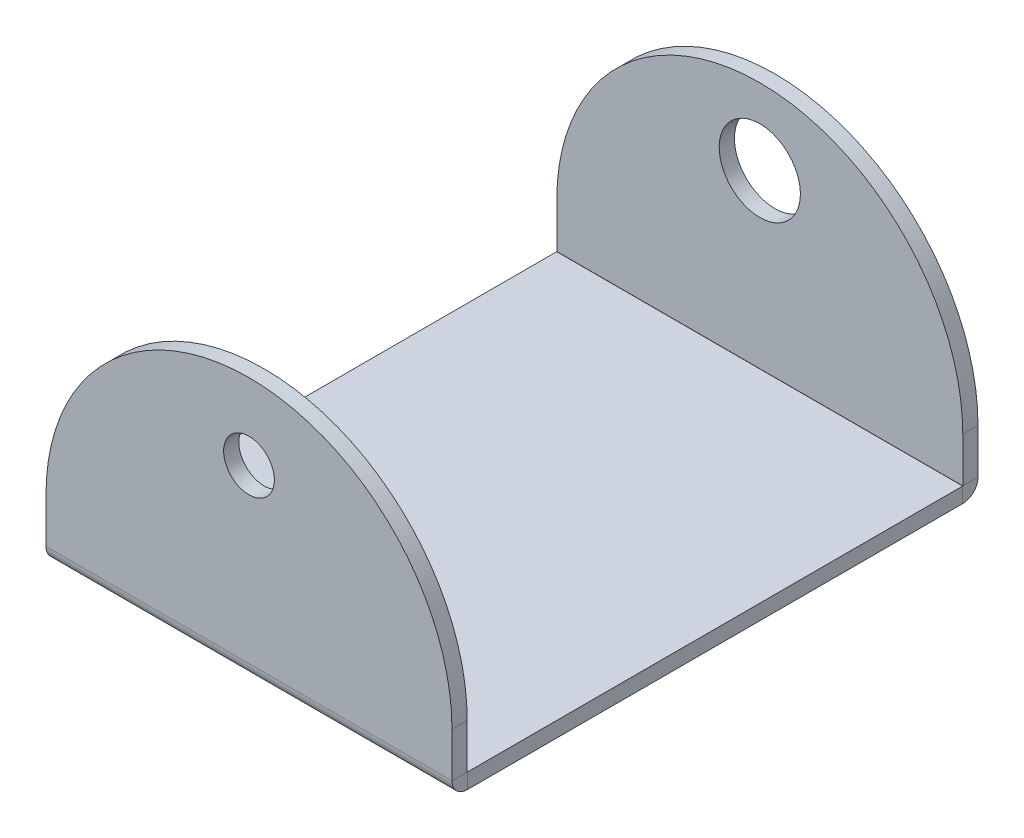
ISO-10303-21;
HEADER;
FILE_DESCRIPTION(('STEP AP214'),'2;1');
FILE_NAME('part.step','',(''),(''),'','','');
FILE_SCHEMA(('AUTOMOTIVE_DESIGN { 1 0 10303 214 1 1 1 1 }'));
ENDSEC;
DATA;
#1=APPLICATION_CONTEXT('core data for automotive mechanical design processes');
#2=APPLICATION_PROTOCOL_DEFINITION('international standard','automotive_design',2000,#1);
#3=PRODUCT_CONTEXT('',#1,'mechanical');
#4=PRODUCT('Part','Part','',(#3));
#5=PRODUCT_RELATED_PRODUCT_CATEGORY('part','',(#4));
#6=PRODUCT_DEFINITION_FORMATION('','',#4);
#7=PRODUCT_DEFINITION_CONTEXT('part definition',#1,'design');
#8=PRODUCT_DEFINITION('design','',#6,#7);
#9=PRODUCT_DEFINITION_SHAPE('','',#8);
#10=(LENGTH_UNIT() NAMED_UNIT(*) SI_UNIT(.MILLI.,.METRE.));
#11=(NAMED_UNIT(*) PLANE_ANGLE_UNIT() SI_UNIT($,.RADIAN.));
#12=(NAMED_UNIT(*) SI_UNIT($,.STERADIAN.) SOLID_ANGLE_UNIT());
#13=UNCERTAINTY_MEASURE_WITH_UNIT(LENGTH_MEASURE(1.E-05),#10,'distance_accuracy_value','');
#14=(GEOMETRIC_REPRESENTATION_CONTEXT(3) GLOBAL_UNCERTAINTY_ASSIGNED_CONTEXT((#13)) GLOBAL_UNIT_ASSIGNED_CONTEXT((#10,
#11,#12)) REPRESENTATION_CONTEXT('',''));
#15=CARTESIAN_POINT('',(0.,0.,0.));
#16=DIRECTION('',(0.,0.,1.));
#17=DIRECTION('',(1.,0.,0.));
#18=AXIS2_PLACEMENT_3D('',#15,#16,#17);
#19=CARTESIAN_POINT('',(20.,1.5,-72.5));
#20=DIRECTION('',(0.,1.,0.));
#21=DIRECTION('',(0.,0.,1.));
#22=AXIS2_PLACEMENT_3D('',#19,#20,#21);
#23=PLANE('',#22);
#24=DIRECTION('',(0.,0.,-1.));
#25=VECTOR('',#24,1.);
#26=CARTESIAN_POINT('',(40.,1.5,-12.5));
#27=LINE('',#26,#25);
#28=CARTESIAN_POINT('',(40.,1.50000000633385,-18.0969026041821));
#29=VERTEX_POINT('',#28);
#30=CARTESIAN_POINT('',(40.,1.5,-66.9030973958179));
#31=VERTEX_POINT('',#30);
#32=EDGE_CURVE('E44',#29,#31,#27,.T.);
#33=ORIENTED_EDGE('',*,*,#32,.T.);
#34=DIRECTION('',(-1.,0.,0.));
#35=VECTOR('',#34,1.);
#36=CARTESIAN_POINT('',(20.,1.5,-66.9030973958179));
#37=LINE('',#36,#35);
#38=CARTESIAN_POINT('',(0.,1.4999999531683,-66.9030973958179));
#39=VERTEX_POINT('',#38);
#40=EDGE_CURVE('E251',#31,#39,#37,.T.);
#41=ORIENTED_EDGE('',*,*,#40,.T.);
#42=DIRECTION('',(0.,0.,1.));
#43=VECTOR('',#42,1.);
#44=CARTESIAN_POINT('',(0.,1.5,-12.5));
#45=LINE('',#44,#43);
#46=CARTESIAN_POINT('',(0.,1.50000001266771,-18.0969026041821));
#47=VERTEX_POINT('',#46);
#48=EDGE_CURVE('E260',#39,#47,#45,.T.);
#49=ORIENTED_EDGE('',*,*,#48,.T.);
#50=DIRECTION('',(-1.,0.,0.));
#51=VECTOR('',#50,1.);
#52=CARTESIAN_POINT('',(20.,1.5,-18.0969026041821));
#53=LINE('',#52,#51);
#54=EDGE_CURVE('E242',#29,#47,#53,.T.);
#55=ORIENTED_EDGE('',*,*,#54,.F.);
#56=EDGE_LOOP('',(#33,#41,#49,#55));
#57=FACE_BOUND('',#56,.T.);
#58=ADVANCED_FACE('F40',(#57),#23,.T.);
#59=CARTESIAN_POINT('',(40.,1.5,-12.5));
#60=DIRECTION('',(-1.,0.,0.));
#61=DIRECTION('',(0.,0.,1.));
#62=AXIS2_PLACEMENT_3D('',#59,#60,#61);
#63=PLANE('',#62);
#64=DIRECTION('',(0.,-1.,0.));
#65=VECTOR('',#64,1.);
#66=CARTESIAN_POINT('',(40.,1.5,-66.9030973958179));
#67=LINE('',#66,#65);
#68=CARTESIAN_POINT('',(40.,0.,-66.9030973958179));
#69=VERTEX_POINT('',#68);
#70=EDGE_CURVE('E254',#31,#69,#67,.T.);
#71=ORIENTED_EDGE('',*,*,#70,.F.);
#72=ORIENTED_EDGE('',*,*,#32,.F.);
#73=DIRECTION('',(0.,-1.,0.));
#74=VECTOR('',#73,1.);
#75=CARTESIAN_POINT('',(40.,1.5,-18.0969026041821));
#76=LINE('',#75,#74);
#77=CARTESIAN_POINT('',(40.,0.,-18.0969026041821));
#78=VERTEX_POINT('',#77);
#79=EDGE_CURVE('E249',#29,#78,#76,.T.);
#80=ORIENTED_EDGE('',*,*,#79,.T.);
#81=DIRECTION('',(0.,0.,-1.));
#82=VECTOR('',#81,1.);
#83=CARTESIAN_POINT('',(40.,0.,-12.5));
#84=LINE('',#83,#82);
#85=EDGE_CURVE('E65',#78,#69,#84,.T.);
#86=ORIENTED_EDGE('',*,*,#85,.T.);
#87=EDGE_LOOP('',(#71,#72,#80,#86));
#88=FACE_BOUND('',#87,.T.);
#89=ADVANCED_FACE('F266',(#88),#63,.F.);
#90=CARTESIAN_POINT('',(0.,1.5,-12.5));
#91=DIRECTION('',(1.,0.,0.));
#92=DIRECTION('',(0.,0.,-1.));
#93=AXIS2_PLACEMENT_3D('',#90,#91,#92);
#94=PLANE('',#93);
#95=DIRECTION('',(0.,1.,0.));
#96=VECTOR('',#95,1.);
#97=CARTESIAN_POINT('',(0.,1.5,-66.9030973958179));
#98=LINE('',#97,#96);
#99=CARTESIAN_POINT('',(0.,0.,-66.9030973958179));
#100=VERTEX_POINT('',#99);
#101=EDGE_CURVE('E12',#100,#39,#98,.T.);
#102=ORIENTED_EDGE('',*,*,#101,.F.);
#103=DIRECTION('',(0.,0.,1.));
#104=VECTOR('',#103,1.);
#105=CARTESIAN_POINT('',(0.,0.,-12.5));
#106=LINE('',#105,#104);
#107=CARTESIAN_POINT('',(0.,1.26677058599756E-08,-18.0969026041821));
#108=VERTEX_POINT('',#107);
#109=EDGE_CURVE('E57',#100,#108,#106,.T.);
#110=ORIENTED_EDGE('',*,*,#109,.T.);
#111=DIRECTION('',(0.,1.,0.));
#112=VECTOR('',#111,1.);
#113=CARTESIAN_POINT('',(0.,1.5,-18.0969026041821));
#114=LINE('',#113,#112);
#115=EDGE_CURVE('E244',#108,#47,#114,.T.);
#116=ORIENTED_EDGE('',*,*,#115,.T.);
#117=ORIENTED_EDGE('',*,*,#48,.F.);
#118=EDGE_LOOP('',(#102,#110,#116,#117));
#119=FACE_BOUND('',#118,.T.);
#120=ADVANCED_FACE('F42',(#119),#94,.F.);
#121=CARTESIAN_POINT('',(20.,0.,-72.5));
#122=DIRECTION('',(0.,1.,0.));
#123=DIRECTION('',(0.,0.,1.));
#124=AXIS2_PLACEMENT_3D('',#121,#122,#123);
#125=PLANE('',#124);
#126=DIRECTION('',(-1.,0.,0.));
#127=VECTOR('',#126,1.);
#128=CARTESIAN_POINT('',(20.,0.,-66.9030973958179));
#129=LINE('',#128,#127);
#130=EDGE_CURVE('E49',#69,#100,#129,.T.);
#131=ORIENTED_EDGE('',*,*,#130,.F.);
#132=ORIENTED_EDGE('',*,*,#85,.F.);
#133=DIRECTION('',(-1.,0.,0.));
#134=VECTOR('',#133,1.);
#135=CARTESIAN_POINT('',(20.,0.,-18.0969026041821));
#136=LINE('',#135,#134);
#137=EDGE_CURVE('E247',#78,#108,#136,.T.);
#138=ORIENTED_EDGE('',*,*,#137,.T.);
#139=ORIENTED_EDGE('',*,*,#109,.F.);
#140=EDGE_LOOP('',(#131,#132,#138,#139));
#141=FACE_BOUND('',#140,.T.);
#142=ADVANCED_FACE('F286',(#141),#125,.F.);
#143=CARTESIAN_POINT('',(40.,1.50999998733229,-18.0969026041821));
#144=DIRECTION('',(-1.,0.,0.));
#145=DIRECTION('',(0.,0.,1.));
#146=AXIS2_PLACEMENT_3D('',#143,#144,#145);
#147=PLANE('',#146);
#148=DIRECTION('',(0.,0.,1.));
#149=VECTOR('',#148,1.);
#150=CARTESIAN_POINT('',(40.,1.51,-18.0869026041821));
#151=LINE('',#150,#149);
#152=CARTESIAN_POINT('',(40.,1.51,-18.0869026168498));
#153=VERTEX_POINT('',#152);
#154=CARTESIAN_POINT('',(40.,1.51000000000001,-16.5869026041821));
#155=VERTEX_POINT('',#154);
#156=EDGE_CURVE('E195',#153,#155,#151,.T.);
#157=ORIENTED_EDGE('',*,*,#156,.T.);
#158=CARTESIAN_POINT('',(40.,1.51,-18.0969026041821));
#159=DIRECTION('',(1.,0.,0.));
#160=DIRECTION('',(0.,0.,-1.));
#161=AXIS2_PLACEMENT_3D('',#158,#159,#160);
#162=CIRCLE('',#161,1.50999998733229);
#163=EDGE_CURVE('E198',#155,#78,#162,.T.);
#164=ORIENTED_EDGE('',*,*,#163,.T.);
#165=ORIENTED_EDGE('',*,*,#79,.F.);
#166=CARTESIAN_POINT('',(40.,1.50999998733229,-18.0969026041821));
#167=DIRECTION('',(1.,0.,0.));
#168=DIRECTION('',(0.,0.,-1.));
#169=AXIS2_PLACEMENT_3D('',#166,#167,#168);
#170=CIRCLE('',#169,0.00999998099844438);
#171=EDGE_CURVE('E236',#153,#29,#170,.T.);
#172=ORIENTED_EDGE('',*,*,#171,.F.);
#173=EDGE_LOOP('',(#157,#164,#165,#172));
#174=FACE_BOUND('',#173,.T.);
#175=ADVANCED_FACE('F290',(#174),#147,.F.);
#176=CARTESIAN_POINT('',(0.,1.50999998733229,-18.0969026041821));
#177=DIRECTION('',(1.,0.,0.));
#178=DIRECTION('',(0.,0.,-1.));
#179=AXIS2_PLACEMENT_3D('',#176,#177,#178);
#180=PLANE('',#179);
#181=CARTESIAN_POINT('',(0.,1.51,-18.0969026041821));
#182=DIRECTION('',(1.,0.,0.));
#183=DIRECTION('',(0.,0.,-1.));
#184=AXIS2_PLACEMENT_3D('',#181,#182,#183);
#185=CIRCLE('',#184,1.50999998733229);
#186=CARTESIAN_POINT('',(0.,1.51000000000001,-16.5869026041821));
#187=VERTEX_POINT('',#186);
#188=EDGE_CURVE('E233',#108,#187,#185,.F.);
#189=ORIENTED_EDGE('',*,*,#188,.T.);
#190=DIRECTION('',(0.,0.,-1.));
#191=VECTOR('',#190,1.);
#192=CARTESIAN_POINT('',(0.,1.51,-18.0869026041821));
#193=LINE('',#192,#191);
#194=CARTESIAN_POINT('',(0.,1.51,-18.0869026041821));
#195=VERTEX_POINT('',#194);
#196=EDGE_CURVE('E224',#187,#195,#193,.T.);
#197=ORIENTED_EDGE('',*,*,#196,.T.);
#198=CARTESIAN_POINT('',(0.,1.50999998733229,-18.0969026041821));
#199=DIRECTION('',(-1.,0.,0.));
#200=DIRECTION('',(0.,0.,1.));
#201=AXIS2_PLACEMENT_3D('',#198,#199,#200);
#202=CIRCLE('',#201,0.00999998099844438);
#203=EDGE_CURVE('E239',#47,#195,#202,.T.);
#204=ORIENTED_EDGE('',*,*,#203,.F.);
#205=ORIENTED_EDGE('',*,*,#115,.F.);
#206=EDGE_LOOP('',(#189,#197,#204,#205));
#207=FACE_BOUND('',#206,.T.);
#208=ADVANCED_FACE('F306',(#207),#180,.F.);
#209=CARTESIAN_POINT('',(-20.0459132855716,1.51,-18.0969026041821));
#210=DIRECTION('',(1.,0.,0.));
#211=DIRECTION('',(0.,0.,-1.));
#212=AXIS2_PLACEMENT_3D('',#209,#210,#211);
#213=CYLINDRICAL_SURFACE('',#212,0.00999998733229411);
#214=ORIENTED_EDGE('',*,*,#54,.T.);
#215=ORIENTED_EDGE('',*,*,#203,.T.);
#216=DIRECTION('',(-1.,0.,0.));
#217=VECTOR('',#216,1.);
#218=CARTESIAN_POINT('',(20.,1.51,-18.0869026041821));
#219=LINE('',#218,#217);
#220=EDGE_CURVE('E211',#153,#195,#219,.T.);
#221=ORIENTED_EDGE('',*,*,#220,.F.);
#222=ORIENTED_EDGE('',*,*,#171,.T.);
#223=EDGE_LOOP('',(#214,#215,#221,#222));
#224=FACE_BOUND('',#223,.T.);
#225=ADVANCED_FACE('F294',(#224),#213,.F.);
#226=CARTESIAN_POINT('',(-20.0459132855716,1.51,-18.0969026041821));
#227=DIRECTION('',(1.,0.,0.));
#228=DIRECTION('',(0.,0.,-1.));
#229=AXIS2_PLACEMENT_3D('',#226,#227,#228);
#230=CYLINDRICAL_SURFACE('',#229,1.50999998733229);
#231=ORIENTED_EDGE('',*,*,#137,.F.);
#232=ORIENTED_EDGE('',*,*,#163,.F.);
#233=DIRECTION('',(-1.,0.,0.));
#234=VECTOR('',#233,1.);
#235=CARTESIAN_POINT('',(20.,1.51000000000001,-16.5869026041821));
#236=LINE('',#235,#234);
#237=EDGE_CURVE('E227',#155,#187,#236,.T.);
#238=ORIENTED_EDGE('',*,*,#237,.T.);
#239=ORIENTED_EDGE('',*,*,#188,.F.);
#240=EDGE_LOOP('',(#231,#232,#238,#239));
#241=FACE_BOUND('',#240,.T.);
#242=ADVANCED_FACE('F309',(#241),#230,.T.);
#243=CARTESIAN_POINT('',(20.,5.91309739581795,-18.0869026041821));
#244=DIRECTION('',(0.,0.,1.));
#245=DIRECTION('',(0.,-1.,0.));
#246=AXIS2_PLACEMENT_3D('',#243,#244,#245);
#247=CYLINDRICAL_SURFACE('',#246,20.);
#248=CARTESIAN_POINT('',(20.,5.91309739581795,-16.5869026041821));
#249=DIRECTION('',(0.,0.,-1.));
#250=DIRECTION('',(0.,1.,0.));
#251=AXIS2_PLACEMENT_3D('',#248,#249,#250);
#252=CIRCLE('',#251,20.);
#253=CARTESIAN_POINT('',(0.,5.91309739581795,-16.5869026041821));
#254=VERTEX_POINT('',#253);
#255=CARTESIAN_POINT('',(40.,5.91309739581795,-16.5869026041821));
#256=VERTEX_POINT('',#255);
#257=EDGE_CURVE('E222',#254,#256,#252,.T.);
#258=ORIENTED_EDGE('',*,*,#257,.T.);
#259=DIRECTION('',(0.,0.,1.));
#260=VECTOR('',#259,1.);
#261=CARTESIAN_POINT('',(40.,5.91309739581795,-18.0869026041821));
#262=LINE('',#261,#260);
#263=CARTESIAN_POINT('',(40.,5.91309739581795,-18.0869026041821));
#264=VERTEX_POINT('',#263);
#265=EDGE_CURVE('E199',#264,#256,#262,.T.);
#266=ORIENTED_EDGE('',*,*,#265,.F.);
#267=CARTESIAN_POINT('',(20.,5.91309739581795,-18.0869026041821));
#268=DIRECTION('',(0.,0.,-1.));
#269=DIRECTION('',(0.,1.,0.));
#270=AXIS2_PLACEMENT_3D('',#267,#268,#269);
#271=CIRCLE('',#270,20.);
#272=CARTESIAN_POINT('',(0.,5.91309739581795,-18.0869026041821));
#273=VERTEX_POINT('',#272);
#274=EDGE_CURVE('E207',#273,#264,#271,.T.);
#275=ORIENTED_EDGE('',*,*,#274,.F.);
#276=DIRECTION('',(0.,0.,1.));
#277=VECTOR('',#276,1.);
#278=CARTESIAN_POINT('',(0.,5.91309739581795,-18.0869026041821));
#279=LINE('',#278,#277);
#280=EDGE_CURVE('E219',#273,#254,#279,.T.);
#281=ORIENTED_EDGE('',*,*,#280,.T.);
#282=EDGE_LOOP('',(#258,#266,#275,#281));
#283=FACE_BOUND('',#282,.T.);
#284=ADVANCED_FACE('F320',(#283),#247,.T.);
#285=CARTESIAN_POINT('',(20.,18.4130973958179,-18.0869026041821));
#286=DIRECTION('',(0.,0.,1.));
#287=DIRECTION('',(0.,-1.,0.));
#288=AXIS2_PLACEMENT_3D('',#285,#286,#287);
#289=CYLINDRICAL_SURFACE('',#288,2.5);
#290=CARTESIAN_POINT('',(20.,18.4130973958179,-18.0869026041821));
#291=DIRECTION('',(0.,0.,-1.));
#292=DIRECTION('',(0.,1.,0.));
#293=AXIS2_PLACEMENT_3D('',#290,#291,#292);
#294=CIRCLE('',#293,2.5);
#295=CARTESIAN_POINT('',(20.,20.9130973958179,-18.0869026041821));
#296=VERTEX_POINT('',#295);
#297=EDGE_CURVE('E216',#296,#296,#294,.T.);
#298=ORIENTED_EDGE('',*,*,#297,.T.);
#299=EDGE_LOOP('',(#298));
#300=FACE_BOUND('',#299,.T.);
#301=CARTESIAN_POINT('',(20.,18.413097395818,-16.5869026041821));
#302=DIRECTION('',(0.,0.,-1.));
#303=DIRECTION('',(0.,1.,0.));
#304=AXIS2_PLACEMENT_3D('',#301,#302,#303);
#305=CIRCLE('',#304,2.5);
#306=CARTESIAN_POINT('',(20.,20.913097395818,-16.5869026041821));
#307=VERTEX_POINT('',#306);
#308=EDGE_CURVE('E202',#307,#307,#305,.T.);
#309=ORIENTED_EDGE('',*,*,#308,.F.);
#310=EDGE_LOOP('',(#309));
#311=FACE_BOUND('',#310,.T.);
#312=ADVANCED_FACE('F322',(#300,#311),#289,.F.);
#313=CARTESIAN_POINT('',(20.,-54.0869026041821,-18.0869026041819));
#314=DIRECTION('',(0.,0.,-1.));
#315=DIRECTION('',(0.,1.,0.));
#316=AXIS2_PLACEMENT_3D('',#313,#314,#315);
#317=PLANE('',#316);
#318=ORIENTED_EDGE('',*,*,#297,.F.);
#319=EDGE_LOOP('',(#318));
#320=FACE_BOUND('',#319,.T.);
#321=DIRECTION('',(0.,-1.,0.));
#322=VECTOR('',#321,1.);
#323=CARTESIAN_POINT('',(40.,5.91309739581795,-18.0869026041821));
#324=LINE('',#323,#322);
#325=EDGE_CURVE('E213',#264,#153,#324,.T.);
#326=ORIENTED_EDGE('',*,*,#325,.T.);
#327=ORIENTED_EDGE('',*,*,#220,.T.);
#328=DIRECTION('',(0.,1.,0.));
#329=VECTOR('',#328,1.);
#330=CARTESIAN_POINT('',(0.,5.91309739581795,-18.0869026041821));
#331=LINE('',#330,#329);
#332=EDGE_CURVE('E209',#195,#273,#331,.T.);
#333=ORIENTED_EDGE('',*,*,#332,.T.);
#334=ORIENTED_EDGE('',*,*,#274,.T.);
#335=EDGE_LOOP('',(#326,#327,#333,#334));
#336=FACE_BOUND('',#335,.T.);
#337=ADVANCED_FACE('F298',(#320,#336),#317,.T.);
#338=CARTESIAN_POINT('',(0.,5.91309739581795,-18.0869026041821));
#339=DIRECTION('',(1.,0.,0.));
#340=DIRECTION('',(0.,-1.,0.));
#341=AXIS2_PLACEMENT_3D('',#338,#339,#340);
#342=PLANE('',#341);
#343=ORIENTED_EDGE('',*,*,#196,.F.);
#344=DIRECTION('',(0.,1.,0.));
#345=VECTOR('',#344,1.);
#346=CARTESIAN_POINT('',(0.,5.91309739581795,-16.5869026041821));
#347=LINE('',#346,#345);
#348=EDGE_CURVE('E205',#187,#254,#347,.T.);
#349=ORIENTED_EDGE('',*,*,#348,.T.);
#350=ORIENTED_EDGE('',*,*,#280,.F.);
#351=ORIENTED_EDGE('',*,*,#332,.F.);
#352=EDGE_LOOP('',(#343,#349,#350,#351));
#353=FACE_BOUND('',#352,.T.);
#354=ADVANCED_FACE('F303',(#353),#342,.F.);
#355=CARTESIAN_POINT('',(20.,-54.0869026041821,-16.5869026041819));
#356=DIRECTION('',(0.,0.,-1.));
#357=DIRECTION('',(0.,1.,0.));
#358=AXIS2_PLACEMENT_3D('',#355,#356,#357);
#359=PLANE('',#358);
#360=ORIENTED_EDGE('',*,*,#237,.F.);
#361=DIRECTION('',(0.,-1.,0.));
#362=VECTOR('',#361,1.);
#363=CARTESIAN_POINT('',(40.,5.91309739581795,-16.5869026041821));
#364=LINE('',#363,#362);
#365=EDGE_CURVE('E196',#256,#155,#364,.T.);
#366=ORIENTED_EDGE('',*,*,#365,.F.);
#367=ORIENTED_EDGE('',*,*,#257,.F.);
#368=ORIENTED_EDGE('',*,*,#348,.F.);
#369=EDGE_LOOP('',(#360,#366,#367,#368));
#370=FACE_BOUND('',#369,.T.);
#371=ORIENTED_EDGE('',*,*,#308,.T.);
#372=EDGE_LOOP('',(#371));
#373=FACE_BOUND('',#372,.T.);
#374=ADVANCED_FACE('F313',(#370,#373),#359,.F.);
#375=CARTESIAN_POINT('',(40.,5.91309739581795,-18.0869026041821));
#376=DIRECTION('',(-1.,0.,0.));
#377=DIRECTION('',(0.,1.,0.));
#378=AXIS2_PLACEMENT_3D('',#375,#376,#377);
#379=PLANE('',#378);
#380=ORIENTED_EDGE('',*,*,#156,.F.);
#381=ORIENTED_EDGE('',*,*,#325,.F.);
#382=ORIENTED_EDGE('',*,*,#265,.T.);
#383=ORIENTED_EDGE('',*,*,#365,.T.);
#384=EDGE_LOOP('',(#380,#381,#382,#383));
#385=FACE_BOUND('',#384,.T.);
#386=ADVANCED_FACE('F317',(#385),#379,.F.);
#387=CARTESIAN_POINT('',(40.,1.5100000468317,-66.9030973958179));
#388=DIRECTION('',(-1.,0.,0.));
#389=DIRECTION('',(0.,0.,1.));
#390=AXIS2_PLACEMENT_3D('',#387,#388,#389);
#391=PLANE('',#390);
#392=ORIENTED_EDGE('',*,*,#70,.T.);
#393=CARTESIAN_POINT('',(40.,1.51,-66.9030973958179));
#394=DIRECTION('',(-1.,0.,0.));
#395=DIRECTION('',(0.,0.,1.));
#396=AXIS2_PLACEMENT_3D('',#393,#394,#395);
#397=CIRCLE('',#396,1.5100000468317);
#398=CARTESIAN_POINT('',(40.,1.51,-68.4130973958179));
#399=VERTEX_POINT('',#398);
#400=EDGE_CURVE('E159',#69,#399,#397,.F.);
#401=ORIENTED_EDGE('',*,*,#400,.T.);
#402=DIRECTION('',(0.,0.,-1.));
#403=VECTOR('',#402,1.);
#404=CARTESIAN_POINT('',(40.,1.51000000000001,-66.9130973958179));
#405=LINE('',#404,#403);
#406=CARTESIAN_POINT('',(40.,1.51,-66.9130973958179));
#407=VERTEX_POINT('',#406);
#408=EDGE_CURVE('E144',#407,#399,#405,.T.);
#409=ORIENTED_EDGE('',*,*,#408,.F.);
#410=CARTESIAN_POINT('',(40.,1.5100000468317,-66.9030973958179));
#411=DIRECTION('',(1.,0.,0.));
#412=DIRECTION('',(0.,0.,-1.));
#413=AXIS2_PLACEMENT_3D('',#410,#411,#412);
#414=CIRCLE('',#413,0.0100000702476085);
#415=EDGE_CURVE('E189',#31,#407,#414,.T.);
#416=ORIENTED_EDGE('',*,*,#415,.F.);
#417=EDGE_LOOP('',(#392,#401,#409,#416));
#418=FACE_BOUND('',#417,.T.);
#419=ADVANCED_FACE('F274',(#418),#391,.F.);
#420=CARTESIAN_POINT('',(0.,1.5100000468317,-66.9030973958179));
#421=DIRECTION('',(1.,0.,0.));
#422=DIRECTION('',(0.,0.,-1.));
#423=AXIS2_PLACEMENT_3D('',#420,#421,#422);
#424=PLANE('',#423);
#425=CARTESIAN_POINT('',(0.,1.51,-66.9030973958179));
#426=DIRECTION('',(-1.,0.,0.));
#427=DIRECTION('',(0.,0.,1.));
#428=AXIS2_PLACEMENT_3D('',#425,#426,#427);
#429=CIRCLE('',#428,1.5100000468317);
#430=CARTESIAN_POINT('',(0.,1.51,-68.4130973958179));
#431=VERTEX_POINT('',#430);
#432=EDGE_CURVE('E162',#431,#100,#429,.T.);
#433=ORIENTED_EDGE('',*,*,#432,.T.);
#434=ORIENTED_EDGE('',*,*,#101,.T.);
#435=CARTESIAN_POINT('',(0.,1.5100000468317,-66.9030973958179));
#436=DIRECTION('',(-1.,0.,0.));
#437=DIRECTION('',(0.,0.,1.));
#438=AXIS2_PLACEMENT_3D('',#435,#436,#437);
#439=CIRCLE('',#438,0.0100000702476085);
#440=CARTESIAN_POINT('',(0.,1.51,-66.9130974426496));
#441=VERTEX_POINT('',#440);
#442=EDGE_CURVE('E192',#441,#39,#439,.T.);
#443=ORIENTED_EDGE('',*,*,#442,.F.);
#444=DIRECTION('',(0.,0.,1.));
#445=VECTOR('',#444,1.);
#446=CARTESIAN_POINT('',(0.,1.51000000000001,-66.9130973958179));
#447=LINE('',#446,#445);
#448=EDGE_CURVE('E141',#431,#441,#447,.T.);
#449=ORIENTED_EDGE('',*,*,#448,.F.);
#450=EDGE_LOOP('',(#433,#434,#443,#449));
#451=FACE_BOUND('',#450,.T.);
#452=ADVANCED_FACE('F284',(#451),#424,.F.);
#453=CARTESIAN_POINT('',(60.0459132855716,1.51,-66.9030973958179));
#454=DIRECTION('',(-1.,0.,0.));
#455=DIRECTION('',(0.,0.,1.));
#456=AXIS2_PLACEMENT_3D('',#453,#454,#455);
#457=CYLINDRICAL_SURFACE('',#456,0.010000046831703);
#458=DIRECTION('',(-1.,0.,0.));
#459=VECTOR('',#458,1.);
#460=CARTESIAN_POINT('',(20.,1.51000000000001,-66.9130973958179));
#461=LINE('',#460,#459);
#462=EDGE_CURVE('E185',#407,#441,#461,.T.);
#463=ORIENTED_EDGE('',*,*,#462,.T.);
#464=ORIENTED_EDGE('',*,*,#442,.T.);
#465=ORIENTED_EDGE('',*,*,#40,.F.);
#466=ORIENTED_EDGE('',*,*,#415,.T.);
#467=EDGE_LOOP('',(#463,#464,#465,#466));
#468=FACE_BOUND('',#467,.T.);
#469=ADVANCED_FACE('F271',(#468),#457,.F.);
#470=CARTESIAN_POINT('',(60.0459132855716,1.51,-66.9030973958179));
#471=DIRECTION('',(-1.,0.,0.));
#472=DIRECTION('',(0.,0.,1.));
#473=AXIS2_PLACEMENT_3D('',#470,#471,#472);
#474=CYLINDRICAL_SURFACE('',#473,1.5100000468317);
#475=DIRECTION('',(-1.,0.,0.));
#476=VECTOR('',#475,1.);
#477=CARTESIAN_POINT('',(20.,1.51000000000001,-68.4130973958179));
#478=LINE('',#477,#476);
#479=EDGE_CURVE('E168',#399,#431,#478,.T.);
#480=ORIENTED_EDGE('',*,*,#479,.F.);
#481=ORIENTED_EDGE('',*,*,#400,.F.);
#482=ORIENTED_EDGE('',*,*,#130,.T.);
#483=ORIENTED_EDGE('',*,*,#432,.F.);
#484=EDGE_LOOP('',(#480,#481,#482,#483));
#485=FACE_BOUND('',#484,.T.);
#486=ADVANCED_FACE('F280',(#485),#474,.T.);
#487=CARTESIAN_POINT('',(20.,18.4130973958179,-66.9130973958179));
#488=DIRECTION('',(0.,0.,-1.));
#489=DIRECTION('',(0.,1.,0.));
#490=AXIS2_PLACEMENT_3D('',#487,#488,#489);
#491=CYLINDRICAL_SURFACE('',#490,4.);
#492=CARTESIAN_POINT('',(20.,18.4130973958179,-66.9130973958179));
#493=DIRECTION('',(0.,0.,1.));
#494=DIRECTION('',(0.,-1.,0.));
#495=AXIS2_PLACEMENT_3D('',#492,#493,#494);
#496=CIRCLE('',#495,4.);
#497=CARTESIAN_POINT('',(20.,14.413097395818,-66.9130973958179));
#498=VERTEX_POINT('',#497);
#499=EDGE_CURVE('E182',#498,#498,#496,.T.);
#500=ORIENTED_EDGE('',*,*,#499,.T.);
#501=EDGE_LOOP('',(#500));
#502=FACE_BOUND('',#501,.T.);
#503=CARTESIAN_POINT('',(20.,18.4130973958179,-68.4130973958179));
#504=DIRECTION('',(0.,0.,1.));
#505=DIRECTION('',(0.,-1.,0.));
#506=AXIS2_PLACEMENT_3D('',#503,#504,#505);
#507=CIRCLE('',#506,4.);
#508=CARTESIAN_POINT('',(20.,14.413097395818,-68.4130973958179));
#509=VERTEX_POINT('',#508);
#510=EDGE_CURVE('E171',#509,#509,#507,.T.);
#511=ORIENTED_EDGE('',*,*,#510,.F.);
#512=EDGE_LOOP('',(#511));
#513=FACE_BOUND('',#512,.T.);
#514=ADVANCED_FACE('F405',(#502,#513),#491,.F.);
#515=CARTESIAN_POINT('',(20.,5.91309739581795,-66.9130973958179));
#516=DIRECTION('',(0.,0.,-1.));
#517=DIRECTION('',(0.,1.,0.));
#518=AXIS2_PLACEMENT_3D('',#515,#516,#517);
#519=CYLINDRICAL_SURFACE('',#518,20.);
#520=CARTESIAN_POINT('',(20.,5.91309739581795,-68.4130973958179));
#521=DIRECTION('',(0.,0.,1.));
#522=DIRECTION('',(0.,-1.,0.));
#523=AXIS2_PLACEMENT_3D('',#520,#521,#522);
#524=CIRCLE('',#523,20.);
#525=CARTESIAN_POINT('',(40.,5.91309739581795,-68.4130973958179));
#526=VERTEX_POINT('',#525);
#527=CARTESIAN_POINT('',(0.,5.91309739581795,-68.4130973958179));
#528=VERTEX_POINT('',#527);
#529=EDGE_CURVE('E158',#526,#528,#524,.T.);
#530=ORIENTED_EDGE('',*,*,#529,.T.);
#531=DIRECTION('',(0.,0.,-1.));
#532=VECTOR('',#531,1.);
#533=CARTESIAN_POINT('',(0.,5.91309739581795,-66.9130973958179));
#534=LINE('',#533,#532);
#535=CARTESIAN_POINT('',(0.,5.91309739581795,-66.9130973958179));
#536=VERTEX_POINT('',#535);
#537=EDGE_CURVE('E138',#536,#528,#534,.T.);
#538=ORIENTED_EDGE('',*,*,#537,.F.);
#539=CARTESIAN_POINT('',(20.,5.91309739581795,-66.9130973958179));
#540=DIRECTION('',(0.,0.,1.));
#541=DIRECTION('',(0.,-1.,0.));
#542=AXIS2_PLACEMENT_3D('',#539,#540,#541);
#543=CIRCLE('',#542,20.);
#544=CARTESIAN_POINT('',(40.,5.91309739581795,-66.9130973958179));
#545=VERTEX_POINT('',#544);
#546=EDGE_CURVE('E145',#545,#536,#543,.T.);
#547=ORIENTED_EDGE('',*,*,#546,.F.);
#548=DIRECTION('',(0.,0.,-1.));
#549=VECTOR('',#548,1.);
#550=CARTESIAN_POINT('',(40.,5.91309739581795,-66.9130973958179));
#551=LINE('',#550,#549);
#552=EDGE_CURVE('E179',#545,#526,#551,.T.);
#553=ORIENTED_EDGE('',*,*,#552,.T.);
#554=EDGE_LOOP('',(#530,#538,#547,#553));
#555=FACE_BOUND('',#554,.T.);
#556=ADVANCED_FACE('F156',(#555),#519,.T.);
#557=CARTESIAN_POINT('',(20.,5.91309739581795,-66.9130973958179));
#558=DIRECTION('',(0.,0.,1.));
#559=DIRECTION('',(0.,-1.,0.));
#560=AXIS2_PLACEMENT_3D('',#557,#558,#559);
#561=PLANE('',#560);
#562=ORIENTED_EDGE('',*,*,#462,.F.);
#563=DIRECTION('',(0.,1.,0.));
#564=VECTOR('',#563,1.);
#565=CARTESIAN_POINT('',(40.,-54.0869026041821,-66.9130973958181));
#566=LINE('',#565,#564);
#567=EDGE_CURVE('E151',#407,#545,#566,.T.);
#568=ORIENTED_EDGE('',*,*,#567,.T.);
#569=ORIENTED_EDGE('',*,*,#546,.T.);
#570=DIRECTION('',(0.,-1.,0.));
#571=VECTOR('',#570,1.);
#572=CARTESIAN_POINT('',(0.,-54.0869026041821,-66.9130973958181));
#573=LINE('',#572,#571);
#574=EDGE_CURVE('E134',#536,#441,#573,.T.);
#575=ORIENTED_EDGE('',*,*,#574,.T.);
#576=EDGE_LOOP('',(#562,#568,#569,#575));
#577=FACE_BOUND('',#576,.T.);
#578=ORIENTED_EDGE('',*,*,#499,.F.);
#579=EDGE_LOOP('',(#578));
#580=FACE_BOUND('',#579,.T.);
#581=ADVANCED_FACE('F148',(#577,#580),#561,.T.);
#582=CARTESIAN_POINT('',(40.,-54.0869026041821,-66.9130973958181));
#583=DIRECTION('',(-1.,0.,0.));
#584=DIRECTION('',(0.,-1.,0.));
#585=AXIS2_PLACEMENT_3D('',#582,#583,#584);
#586=PLANE('',#585);
#587=ORIENTED_EDGE('',*,*,#567,.F.);
#588=ORIENTED_EDGE('',*,*,#408,.T.);
#589=DIRECTION('',(0.,1.,0.));
#590=VECTOR('',#589,1.);
#591=CARTESIAN_POINT('',(40.,-54.0869026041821,-68.4130973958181));
#592=LINE('',#591,#590);
#593=EDGE_CURVE('E174',#399,#526,#592,.T.);
#594=ORIENTED_EDGE('',*,*,#593,.T.);
#595=ORIENTED_EDGE('',*,*,#552,.F.);
#596=EDGE_LOOP('',(#587,#588,#594,#595));
#597=FACE_BOUND('',#596,.T.);
#598=ADVANCED_FACE('F277',(#597),#586,.F.);
#599=CARTESIAN_POINT('',(20.,5.91309739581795,-68.4130973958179));
#600=DIRECTION('',(0.,0.,1.));
#601=DIRECTION('',(0.,-1.,0.));
#602=AXIS2_PLACEMENT_3D('',#599,#600,#601);
#603=PLANE('',#602);
#604=ORIENTED_EDGE('',*,*,#510,.T.);
#605=EDGE_LOOP('',(#604));
#606=FACE_BOUND('',#605,.T.);
#607=ORIENTED_EDGE('',*,*,#593,.F.);
#608=ORIENTED_EDGE('',*,*,#479,.T.);
#609=DIRECTION('',(0.,-1.,0.));
#610=VECTOR('',#609,1.);
#611=CARTESIAN_POINT('',(0.,-54.0869026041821,-68.4130973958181));
#612=LINE('',#611,#610);
#613=EDGE_CURVE('E164',#528,#431,#612,.T.);
#614=ORIENTED_EDGE('',*,*,#613,.F.);
#615=ORIENTED_EDGE('',*,*,#529,.F.);
#616=EDGE_LOOP('',(#607,#608,#614,#615));
#617=FACE_BOUND('',#616,.T.);
#618=ADVANCED_FACE('F282',(#606,#617),#603,.F.);
#619=CARTESIAN_POINT('',(0.,-54.0869026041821,-66.9130973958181));
#620=DIRECTION('',(1.,0.,0.));
#621=DIRECTION('',(0.,1.,0.));
#622=AXIS2_PLACEMENT_3D('',#619,#620,#621);
#623=PLANE('',#622);
#624=ORIENTED_EDGE('',*,*,#613,.T.);
#625=ORIENTED_EDGE('',*,*,#448,.T.);
#626=ORIENTED_EDGE('',*,*,#574,.F.);
#627=ORIENTED_EDGE('',*,*,#537,.T.);
#628=EDGE_LOOP('',(#624,#625,#626,#627));
#629=FACE_BOUND('',#628,.T.);
#630=ADVANCED_FACE('F136',(#629),#623,.F.);
#631=CLOSED_SHELL('',(#58,#89,#120,#142,#175,#208,#225,#242,#284,#312,#337,#354,#374,#386,#419,
#452,#469,#486,#514,#556,#581,#598,#618,#630));
#632=MANIFOLD_SOLID_BREP('B2',#631);
#633=ADVANCED_BREP_SHAPE_REPRESENTATION('',(#18,#632),#14);
#634=SHAPE_DEFINITION_REPRESENTATION(#9,#633);
ENDSEC;
END-ISO-10303-21;
